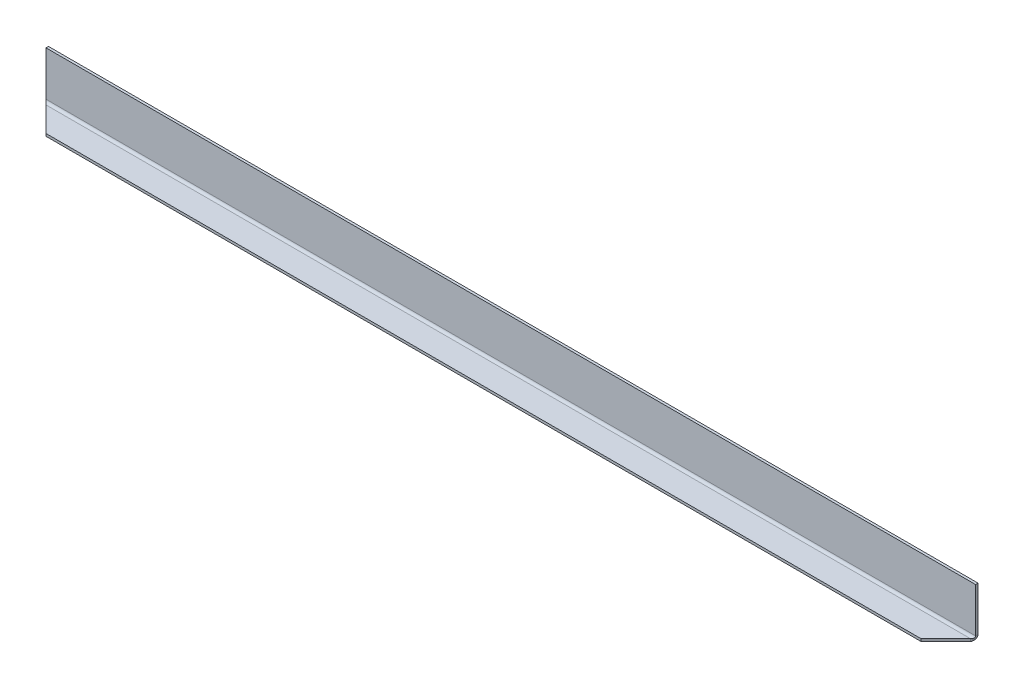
ISO-10303-21;
HEADER;
FILE_DESCRIPTION(('STEP AP214'),'2;1');
FILE_NAME('part.step','',(''),(''),'','','');
FILE_SCHEMA(('AUTOMOTIVE_DESIGN { 1 0 10303 214 1 1 1 1 }'));
ENDSEC;
DATA;
#1=APPLICATION_CONTEXT('core data for automotive mechanical design processes');
#2=APPLICATION_PROTOCOL_DEFINITION('international standard','automotive_design',2000,#1);
#3=PRODUCT_CONTEXT('',#1,'mechanical');
#4=PRODUCT('Part','Part','',(#3));
#5=PRODUCT_RELATED_PRODUCT_CATEGORY('part','',(#4));
#6=PRODUCT_DEFINITION_FORMATION('','',#4);
#7=PRODUCT_DEFINITION_CONTEXT('part definition',#1,'design');
#8=PRODUCT_DEFINITION('design','',#6,#7);
#9=PRODUCT_DEFINITION_SHAPE('','',#8);
#10=(LENGTH_UNIT() NAMED_UNIT(*) SI_UNIT(.MILLI.,.METRE.));
#11=(NAMED_UNIT(*) PLANE_ANGLE_UNIT() SI_UNIT($,.RADIAN.));
#12=(NAMED_UNIT(*) SI_UNIT($,.STERADIAN.) SOLID_ANGLE_UNIT());
#13=UNCERTAINTY_MEASURE_WITH_UNIT(LENGTH_MEASURE(1.E-05),#10,'distance_accuracy_value','');
#14=(GEOMETRIC_REPRESENTATION_CONTEXT(3) GLOBAL_UNCERTAINTY_ASSIGNED_CONTEXT((#13)) GLOBAL_UNIT_ASSIGNED_CONTEXT((#10,
#11,#12)) REPRESENTATION_CONTEXT('',''));
#15=CARTESIAN_POINT('',(0.,0.,0.));
#16=DIRECTION('',(0.,0.,1.));
#17=DIRECTION('',(1.,0.,0.));
#18=AXIS2_PLACEMENT_3D('',#15,#16,#17);
#19=CARTESIAN_POINT('',(637.101544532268,1.5875,0.));
#20=DIRECTION('',(0.,-1.,0.));
#21=DIRECTION('',(0.,0.,-1.));
#22=AXIS2_PLACEMENT_3D('',#19,#20,#21);
#23=PLANE('',#22);
#24=DIRECTION('',(-0.707106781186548,0.,-0.707106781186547));
#25=VECTOR('',#24,1.);
#26=CARTESIAN_POINT('',(318.550772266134,1.58749999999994,318.550772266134));
#27=LINE('',#26,#25);
#28=CARTESIAN_POINT('',(19.05,1.5875,19.05));
#29=VERTEX_POINT('',#28);
#30=CARTESIAN_POINT('',(3.17500000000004,1.5875,3.175));
#31=VERTEX_POINT('',#30);
#32=EDGE_CURVE('E176',#29,#31,#27,.T.);
#33=ORIENTED_EDGE('',*,*,#32,.F.);
#34=DIRECTION('',(-1.,0.,0.));
#35=VECTOR('',#34,1.);
#36=CARTESIAN_POINT('',(637.101544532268,1.5875,19.05));
#37=LINE('',#36,#35);
#38=CARTESIAN_POINT('',(581.025,1.58749999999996,19.05));
#39=VERTEX_POINT('',#38);
#40=EDGE_CURVE('E11',#39,#29,#37,.T.);
#41=ORIENTED_EDGE('',*,*,#40,.F.);
#42=DIRECTION('',(0.70710678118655,0.,-0.707106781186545));
#43=VECTOR('',#42,1.);
#44=CARTESIAN_POINT('',(618.588272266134,1.5875,-18.5132722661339));
#45=LINE('',#44,#43);
#46=CARTESIAN_POINT('',(596.9,1.5875,3.175));
#47=VERTEX_POINT('',#46);
#48=EDGE_CURVE('E200',#39,#47,#45,.T.);
#49=ORIENTED_EDGE('',*,*,#48,.T.);
#50=DIRECTION('',(-1.,0.,0.));
#51=VECTOR('',#50,1.);
#52=CARTESIAN_POINT('',(637.101544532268,1.5875,3.175));
#53=LINE('',#52,#51);
#54=EDGE_CURVE('E212',#47,#31,#53,.T.);
#55=ORIENTED_EDGE('',*,*,#54,.T.);
#56=EDGE_LOOP('',(#33,#41,#49,#55));
#57=FACE_BOUND('',#56,.T.);
#58=ADVANCED_FACE('F48',(#57),#23,.F.);
#59=CARTESIAN_POINT('',(637.101544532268,0.,19.05));
#60=DIRECTION('',(0.,0.,1.));
#61=DIRECTION('',(1.,0.,0.));
#62=AXIS2_PLACEMENT_3D('',#59,#60,#61);
#63=PLANE('',#62);
#64=ORIENTED_EDGE('',*,*,#40,.T.);
#65=DIRECTION('',(0.,-1.,0.));
#66=VECTOR('',#65,1.);
#67=CARTESIAN_POINT('',(19.05,0.,19.05));
#68=LINE('',#67,#66);
#69=CARTESIAN_POINT('',(19.05,0.,19.05));
#70=VERTEX_POINT('',#69);
#71=EDGE_CURVE('E172',#70,#29,#68,.F.);
#72=ORIENTED_EDGE('',*,*,#71,.F.);
#73=DIRECTION('',(-1.,0.,0.));
#74=VECTOR('',#73,1.);
#75=CARTESIAN_POINT('',(637.101544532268,0.,19.05));
#76=LINE('',#75,#74);
#77=CARTESIAN_POINT('',(581.025,0.,19.05));
#78=VERTEX_POINT('',#77);
#79=EDGE_CURVE('E56',#78,#70,#76,.T.);
#80=ORIENTED_EDGE('',*,*,#79,.F.);
#81=DIRECTION('',(0.,1.,0.));
#82=VECTOR('',#81,1.);
#83=CARTESIAN_POINT('',(581.025,1.58749999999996,19.05));
#84=LINE('',#83,#82);
#85=EDGE_CURVE('E170',#39,#78,#84,.F.);
#86=ORIENTED_EDGE('',*,*,#85,.F.);
#87=EDGE_LOOP('',(#64,#72,#80,#86));
#88=FACE_BOUND('',#87,.T.);
#89=ADVANCED_FACE('F169',(#88),#63,.T.);
#90=CARTESIAN_POINT('',(637.101544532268,0.,0.));
#91=DIRECTION('',(0.,-1.,0.));
#92=DIRECTION('',(0.,0.,-1.));
#93=AXIS2_PLACEMENT_3D('',#90,#91,#92);
#94=PLANE('',#93);
#95=ORIENTED_EDGE('',*,*,#79,.T.);
#96=DIRECTION('',(-0.707106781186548,0.,-0.707106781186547));
#97=VECTOR('',#96,1.);
#98=CARTESIAN_POINT('',(318.550772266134,0.,318.550772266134));
#99=LINE('',#98,#97);
#100=CARTESIAN_POINT('',(3.17500000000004,0.,3.175));
#101=VERTEX_POINT('',#100);
#102=EDGE_CURVE('E126',#70,#101,#99,.T.);
#103=ORIENTED_EDGE('',*,*,#102,.T.);
#104=DIRECTION('',(-1.,0.,0.));
#105=VECTOR('',#104,1.);
#106=CARTESIAN_POINT('',(637.101544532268,0.,3.175));
#107=LINE('',#106,#105);
#108=CARTESIAN_POINT('',(596.9,0.,3.175));
#109=VERTEX_POINT('',#108);
#110=EDGE_CURVE('E148',#109,#101,#107,.T.);
#111=ORIENTED_EDGE('',*,*,#110,.F.);
#112=DIRECTION('',(0.70710678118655,0.,-0.707106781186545));
#113=VECTOR('',#112,1.);
#114=CARTESIAN_POINT('',(618.588272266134,0.,-18.5132722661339));
#115=LINE('',#114,#113);
#116=EDGE_CURVE('E165',#78,#109,#115,.T.);
#117=ORIENTED_EDGE('',*,*,#116,.F.);
#118=EDGE_LOOP('',(#95,#103,#111,#117));
#119=FACE_BOUND('',#118,.T.);
#120=ADVANCED_FACE('F163',(#119),#94,.T.);
#121=CARTESIAN_POINT('',(637.101544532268,3.175,3.175));
#122=DIRECTION('',(-1.,0.,0.));
#123=DIRECTION('',(0.,0.,1.));
#124=AXIS2_PLACEMENT_3D('',#121,#122,#123);
#125=CYLINDRICAL_SURFACE('',#124,3.175);
#126=ORIENTED_EDGE('',*,*,#110,.T.);
#127=CARTESIAN_POINT('',(3.17500000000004,3.175,3.175));
#128=DIRECTION('',(-0.894427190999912,0.,0.447213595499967));
#129=DIRECTION('',(-0.447213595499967,0.,-0.894427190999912));
#130=AXIS2_PLACEMENT_3D('',#127,#128,#129);
#131=ELLIPSE('',#130,3.54975791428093,3.175);
#132=CARTESIAN_POINT('',(1.58750000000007,3.175,0.));
#133=VERTEX_POINT('',#132);
#134=EDGE_CURVE('E230',#101,#133,#131,.F.);
#135=ORIENTED_EDGE('',*,*,#134,.T.);
#136=DIRECTION('',(-1.,0.,0.));
#137=VECTOR('',#136,1.);
#138=CARTESIAN_POINT('',(637.101544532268,3.175,0.));
#139=LINE('',#138,#137);
#140=CARTESIAN_POINT('',(598.4875,3.175,0.));
#141=VERTEX_POINT('',#140);
#142=EDGE_CURVE('E136',#141,#133,#139,.T.);
#143=ORIENTED_EDGE('',*,*,#142,.F.);
#144=CARTESIAN_POINT('',(596.9,3.175,3.175));
#145=DIRECTION('',(-0.89442719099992,0.,-0.44721359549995));
#146=DIRECTION('',(-0.44721359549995,0.,0.89442719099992));
#147=AXIS2_PLACEMENT_3D('',#144,#145,#146);
#148=ELLIPSE('',#147,3.5497579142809,3.175);
#149=EDGE_CURVE('E186',#109,#141,#148,.F.);
#150=ORIENTED_EDGE('',*,*,#149,.F.);
#151=EDGE_LOOP('',(#126,#135,#143,#150));
#152=FACE_BOUND('',#151,.T.);
#153=ADVANCED_FACE('F247',(#152),#125,.T.);
#154=CARTESIAN_POINT('',(637.101544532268,0.,0.));
#155=DIRECTION('',(0.,0.,-1.));
#156=DIRECTION('',(-1.,0.,0.));
#157=AXIS2_PLACEMENT_3D('',#154,#155,#156);
#158=PLANE('',#157);
#159=ORIENTED_EDGE('',*,*,#142,.T.);
#160=DIRECTION('',(0.,1.,0.));
#161=VECTOR('',#160,1.);
#162=CARTESIAN_POINT('',(1.58750000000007,0.,0.));
#163=LINE('',#162,#161);
#164=CARTESIAN_POINT('',(1.58749999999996,31.75,0.));
#165=VERTEX_POINT('',#164);
#166=EDGE_CURVE('E117',#133,#165,#163,.T.);
#167=ORIENTED_EDGE('',*,*,#166,.T.);
#168=DIRECTION('',(-1.,0.,0.));
#169=VECTOR('',#168,1.);
#170=CARTESIAN_POINT('',(637.101544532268,31.75,0.));
#171=LINE('',#170,#169);
#172=CARTESIAN_POINT('',(598.4875,31.75,0.));
#173=VERTEX_POINT('',#172);
#174=EDGE_CURVE('E134',#173,#165,#171,.T.);
#175=ORIENTED_EDGE('',*,*,#174,.F.);
#176=DIRECTION('',(0.,1.,0.));
#177=VECTOR('',#176,1.);
#178=CARTESIAN_POINT('',(598.4875,0.,0.));
#179=LINE('',#178,#177);
#180=EDGE_CURVE('E192',#141,#173,#179,.T.);
#181=ORIENTED_EDGE('',*,*,#180,.F.);
#182=EDGE_LOOP('',(#159,#167,#175,#181));
#183=FACE_BOUND('',#182,.T.);
#184=ADVANCED_FACE('F132',(#183),#158,.T.);
#185=CARTESIAN_POINT('',(637.101544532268,31.75,1.5875));
#186=DIRECTION('',(0.,1.,0.));
#187=DIRECTION('',(0.,0.,1.));
#188=AXIS2_PLACEMENT_3D('',#185,#186,#187);
#189=PLANE('',#188);
#190=ORIENTED_EDGE('',*,*,#174,.T.);
#191=DIRECTION('',(0.,0.,1.));
#192=VECTOR('',#191,1.);
#193=CARTESIAN_POINT('',(1.58749999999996,31.75,1.5875));
#194=LINE('',#193,#192);
#195=CARTESIAN_POINT('',(1.58749999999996,31.75,1.5875));
#196=VERTEX_POINT('',#195);
#197=EDGE_CURVE('E113',#196,#165,#194,.F.);
#198=ORIENTED_EDGE('',*,*,#197,.F.);
#199=DIRECTION('',(-1.,0.,0.));
#200=VECTOR('',#199,1.);
#201=CARTESIAN_POINT('',(637.101544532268,31.75,1.5875));
#202=LINE('',#201,#200);
#203=CARTESIAN_POINT('',(598.4875,31.75,1.5875));
#204=VERTEX_POINT('',#203);
#205=EDGE_CURVE('E143',#204,#196,#202,.T.);
#206=ORIENTED_EDGE('',*,*,#205,.F.);
#207=DIRECTION('',(0.,0.,1.));
#208=VECTOR('',#207,1.);
#209=CARTESIAN_POINT('',(598.4875,31.75,1.5875));
#210=LINE('',#209,#208);
#211=EDGE_CURVE('E141',#204,#173,#210,.F.);
#212=ORIENTED_EDGE('',*,*,#211,.T.);
#213=EDGE_LOOP('',(#190,#198,#206,#212));
#214=FACE_BOUND('',#213,.T.);
#215=ADVANCED_FACE('F140',(#214),#189,.T.);
#216=CARTESIAN_POINT('',(637.101544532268,0.,1.5875));
#217=DIRECTION('',(0.,0.,-1.));
#218=DIRECTION('',(-1.,0.,0.));
#219=AXIS2_PLACEMENT_3D('',#216,#217,#218);
#220=PLANE('',#219);
#221=DIRECTION('',(0.,1.,0.));
#222=VECTOR('',#221,1.);
#223=CARTESIAN_POINT('',(1.58749999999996,0.,1.5875));
#224=LINE('',#223,#222);
#225=CARTESIAN_POINT('',(1.58750000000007,3.175,1.5875));
#226=VERTEX_POINT('',#225);
#227=EDGE_CURVE('E120',#226,#196,#224,.T.);
#228=ORIENTED_EDGE('',*,*,#227,.F.);
#229=DIRECTION('',(-1.,0.,0.));
#230=VECTOR('',#229,1.);
#231=CARTESIAN_POINT('',(637.101544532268,3.175,1.5875));
#232=LINE('',#231,#230);
#233=CARTESIAN_POINT('',(598.4875,3.175,1.5875));
#234=VERTEX_POINT('',#233);
#235=EDGE_CURVE('E150',#234,#226,#232,.T.);
#236=ORIENTED_EDGE('',*,*,#235,.F.);
#237=DIRECTION('',(0.,1.,0.));
#238=VECTOR('',#237,1.);
#239=CARTESIAN_POINT('',(598.4875,0.,1.5875));
#240=LINE('',#239,#238);
#241=EDGE_CURVE('E71',#234,#204,#240,.T.);
#242=ORIENTED_EDGE('',*,*,#241,.T.);
#243=ORIENTED_EDGE('',*,*,#205,.T.);
#244=EDGE_LOOP('',(#228,#236,#242,#243));
#245=FACE_BOUND('',#244,.T.);
#246=ADVANCED_FACE('F228',(#245),#220,.F.);
#247=CARTESIAN_POINT('',(637.101544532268,3.175,3.175));
#248=DIRECTION('',(-1.,0.,0.));
#249=DIRECTION('',(0.,0.,1.));
#250=AXIS2_PLACEMENT_3D('',#247,#248,#249);
#251=CYLINDRICAL_SURFACE('',#250,1.5875);
#252=CARTESIAN_POINT('',(3.17500000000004,3.175,3.175));
#253=DIRECTION('',(-0.707106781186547,0.,0.707106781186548));
#254=DIRECTION('',(-0.707106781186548,0.,-0.707106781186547));
#255=AXIS2_PLACEMENT_3D('',#252,#253,#254);
#256=ELLIPSE('',#255,2.24506403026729,1.5875);
#257=EDGE_CURVE('E225',#31,#226,#256,.F.);
#258=ORIENTED_EDGE('',*,*,#257,.F.);
#259=ORIENTED_EDGE('',*,*,#54,.F.);
#260=CARTESIAN_POINT('',(596.9,3.175,3.175));
#261=DIRECTION('',(-0.707106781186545,0.,-0.70710678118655));
#262=DIRECTION('',(-0.70710678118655,0.,0.707106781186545));
#263=AXIS2_PLACEMENT_3D('',#260,#261,#262);
#264=ELLIPSE('',#263,2.2450640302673,1.5875);
#265=EDGE_CURVE('E181',#47,#234,#264,.F.);
#266=ORIENTED_EDGE('',*,*,#265,.T.);
#267=ORIENTED_EDGE('',*,*,#235,.T.);
#268=EDGE_LOOP('',(#258,#259,#266,#267));
#269=FACE_BOUND('',#268,.T.);
#270=ADVANCED_FACE('F223',(#269),#251,.F.);
#271=CARTESIAN_POINT('',(618.588272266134,1.5875,-18.5132722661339));
#272=DIRECTION('',(-0.707106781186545,0.,-0.70710678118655));
#273=DIRECTION('',(0.70710678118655,0.,-0.707106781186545));
#274=AXIS2_PLACEMENT_3D('',#271,#272,#273);
#275=PLANE('',#274);
#276=DIRECTION('',(0.,1.,0.));
#277=VECTOR('',#276,1.);
#278=CARTESIAN_POINT('',(596.9,1.5875,3.175));
#279=LINE('',#278,#277);
#280=EDGE_CURVE('E208',#47,#109,#279,.F.);
#281=ORIENTED_EDGE('',*,*,#280,.F.);
#282=ORIENTED_EDGE('',*,*,#48,.F.);
#283=ORIENTED_EDGE('',*,*,#85,.T.);
#284=ORIENTED_EDGE('',*,*,#116,.T.);
#285=EDGE_LOOP('',(#281,#282,#283,#284));
#286=FACE_BOUND('',#285,.T.);
#287=ADVANCED_FACE('F253',(#286),#275,.F.);
#288=CARTESIAN_POINT('',(598.4875,0.,1.5875));
#289=DIRECTION('',(-1.,0.,0.));
#290=DIRECTION('',(0.,1.,0.));
#291=AXIS2_PLACEMENT_3D('',#288,#289,#290);
#292=PLANE('',#291);
#293=ORIENTED_EDGE('',*,*,#211,.F.);
#294=ORIENTED_EDGE('',*,*,#241,.F.);
#295=DIRECTION('',(0.,0.,1.));
#296=VECTOR('',#295,1.);
#297=CARTESIAN_POINT('',(598.4875,3.175,1.5875));
#298=LINE('',#297,#296);
#299=EDGE_CURVE('E195',#234,#141,#298,.F.);
#300=ORIENTED_EDGE('',*,*,#299,.T.);
#301=ORIENTED_EDGE('',*,*,#180,.T.);
#302=EDGE_LOOP('',(#293,#294,#300,#301));
#303=FACE_BOUND('',#302,.T.);
#304=ADVANCED_FACE('F251',(#303),#292,.F.);
#305=CARTESIAN_POINT('',(595.3125,3.175,6.35));
#306=CARTESIAN_POINT('',(595.3125,3.175,5.82083333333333));
#307=CARTESIAN_POINT('',(595.3125,3.175,5.29166666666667));
#308=CARTESIAN_POINT('',(595.3125,3.175,4.7625));
#309=CARTESIAN_POINT('',(595.3125,-3.175,6.35));
#310=CARTESIAN_POINT('',(595.3125,-2.11666666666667,5.82083333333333));
#311=CARTESIAN_POINT('',(595.3125,-1.05833333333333,5.29166666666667));
#312=CARTESIAN_POINT('',(595.3125,0.,4.7625));
#313=CARTESIAN_POINT('',(598.4875,-3.175,0.));
#314=CARTESIAN_POINT('',(598.4875,-2.11666666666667,0.529166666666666));
#315=CARTESIAN_POINT('',(598.4875,-1.05833333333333,1.05833333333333));
#316=CARTESIAN_POINT('',(598.4875,0.,1.5875));
#317=CARTESIAN_POINT('',(598.4875,3.175,0.));
#318=CARTESIAN_POINT('',(598.4875,3.175,0.529166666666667));
#319=CARTESIAN_POINT('',(598.4875,3.175,1.05833333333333));
#320=CARTESIAN_POINT('',(598.4875,3.175,1.5875));
#321=CARTESIAN_POINT('',(598.4875,9.525,0.));
#322=CARTESIAN_POINT('',(598.4875,8.46666666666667,0.529166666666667));
#323=CARTESIAN_POINT('',(598.4875,7.40833333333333,1.05833333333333));
#324=CARTESIAN_POINT('',(598.4875,6.35,1.5875));
#325=CARTESIAN_POINT('',(595.3125,9.525,6.35));
#326=CARTESIAN_POINT('',(595.3125,8.46666666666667,5.82083333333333));
#327=CARTESIAN_POINT('',(595.3125,7.40833333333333,5.29166666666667));
#328=CARTESIAN_POINT('',(595.3125,6.35,4.7625));
#329=CARTESIAN_POINT('',(595.3125,3.175,6.35));
#330=CARTESIAN_POINT('',(595.3125,3.175,5.82083333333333));
#331=CARTESIAN_POINT('',(595.3125,3.175,5.29166666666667));
#332=CARTESIAN_POINT('',(595.3125,3.175,4.7625));
#333=(BOUNDED_SURFACE() B_SPLINE_SURFACE(3,3,((#305,#306,#307,#308),(#309,#310,#311,#312),(#313,
#314,#315,#316),(#317,#318,#319,#320),(#321,#322,#323,#324),(#325,#326,#327,#328),(#329,#330,
#331,#332)),.UNSPECIFIED.,.T.,.F.,.F.) B_SPLINE_SURFACE_WITH_KNOTS((4,3,4),(4,4),(0.,0.5,1.),
(0.,1.),.UNSPECIFIED.) GEOMETRIC_REPRESENTATION_ITEM() RATIONAL_B_SPLINE_SURFACE(((1.,1.,1.,1.),
(0.333333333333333,0.333333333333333,0.333333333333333,0.333333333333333),(0.333333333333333,
0.333333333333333,0.333333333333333,0.333333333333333),(1.,1.,1.,1.),(0.333333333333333,
0.333333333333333,0.333333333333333,0.333333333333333),(0.333333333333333,0.333333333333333,
0.333333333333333,0.333333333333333),(1.,1.,1.,1.))) REPRESENTATION_ITEM('') SURFACE());
#334=ORIENTED_EDGE('',*,*,#299,.F.);
#335=ORIENTED_EDGE('',*,*,#265,.F.);
#336=ORIENTED_EDGE('',*,*,#280,.T.);
#337=ORIENTED_EDGE('',*,*,#149,.T.);
#338=EDGE_LOOP('',(#334,#335,#336,#337));
#339=FACE_BOUND('',#338,.T.);
#340=ADVANCED_FACE('F250',(#339),#333,.T.);
#341=CARTESIAN_POINT('',(318.550772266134,0.,318.550772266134));
#342=DIRECTION('',(-0.707106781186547,0.,0.707106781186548));
#343=DIRECTION('',(-0.707106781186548,0.,-0.707106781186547));
#344=AXIS2_PLACEMENT_3D('',#341,#342,#343);
#345=PLANE('',#344);
#346=DIRECTION('',(0.,-1.,0.));
#347=VECTOR('',#346,1.);
#348=CARTESIAN_POINT('',(3.17500000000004,0.,3.175));
#349=LINE('',#348,#347);
#350=EDGE_CURVE('E63',#101,#31,#349,.F.);
#351=ORIENTED_EDGE('',*,*,#350,.F.);
#352=ORIENTED_EDGE('',*,*,#102,.F.);
#353=ORIENTED_EDGE('',*,*,#71,.T.);
#354=ORIENTED_EDGE('',*,*,#32,.T.);
#355=EDGE_LOOP('',(#351,#352,#353,#354));
#356=FACE_BOUND('',#355,.T.);
#357=ADVANCED_FACE('F259',(#356),#345,.T.);
#358=CARTESIAN_POINT('',(1.58749999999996,0.,1.5875));
#359=DIRECTION('',(-1.,0.,0.));
#360=DIRECTION('',(0.,1.,0.));
#361=AXIS2_PLACEMENT_3D('',#358,#359,#360);
#362=PLANE('',#361);
#363=ORIENTED_EDGE('',*,*,#227,.T.);
#364=ORIENTED_EDGE('',*,*,#197,.T.);
#365=ORIENTED_EDGE('',*,*,#166,.F.);
#366=DIRECTION('',(0.,0.,1.));
#367=VECTOR('',#366,1.);
#368=CARTESIAN_POINT('',(1.58750000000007,3.175,1.5875));
#369=LINE('',#368,#367);
#370=EDGE_CURVE('E127',#226,#133,#369,.F.);
#371=ORIENTED_EDGE('',*,*,#370,.F.);
#372=EDGE_LOOP('',(#363,#364,#365,#371));
#373=FACE_BOUND('',#372,.T.);
#374=ADVANCED_FACE('F115',(#373),#362,.T.);
#375=CARTESIAN_POINT('',(1.5875,3.175,0.));
#376=CARTESIAN_POINT('',(1.58750000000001,3.175,0.529166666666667));
#377=CARTESIAN_POINT('',(1.58750000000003,3.175,1.05833333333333));
#378=CARTESIAN_POINT('',(1.58750000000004,3.175,1.5875));
#379=CARTESIAN_POINT('',(1.5875,9.525,0.));
#380=CARTESIAN_POINT('',(1.58750000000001,8.46666666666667,0.529166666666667));
#381=CARTESIAN_POINT('',(1.58750000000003,7.40833333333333,1.05833333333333));
#382=CARTESIAN_POINT('',(1.58750000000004,6.35,1.5875));
#383=CARTESIAN_POINT('',(4.76250000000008,9.525,6.35));
#384=CARTESIAN_POINT('',(4.76250000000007,8.46666666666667,5.82083333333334));
#385=CARTESIAN_POINT('',(4.76250000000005,7.40833333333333,5.29166666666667));
#386=CARTESIAN_POINT('',(4.76250000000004,6.35,4.7625));
#387=CARTESIAN_POINT('',(4.76250000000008,3.175,6.35));
#388=CARTESIAN_POINT('',(4.76250000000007,3.175,5.82083333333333));
#389=CARTESIAN_POINT('',(4.76250000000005,3.175,5.29166666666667));
#390=CARTESIAN_POINT('',(4.76250000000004,3.175,4.7625));
#391=CARTESIAN_POINT('',(4.76250000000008,-3.175,6.35));
#392=CARTESIAN_POINT('',(4.76250000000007,-2.11666666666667,5.82083333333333));
#393=CARTESIAN_POINT('',(4.76250000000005,-1.05833333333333,5.29166666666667));
#394=CARTESIAN_POINT('',(4.76250000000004,0.,4.7625));
#395=CARTESIAN_POINT('',(1.5875,-3.175,0.));
#396=CARTESIAN_POINT('',(1.58750000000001,-2.11666666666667,0.529166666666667));
#397=CARTESIAN_POINT('',(1.58750000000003,-1.05833333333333,1.05833333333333));
#398=CARTESIAN_POINT('',(1.58750000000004,0.,1.5875));
#399=CARTESIAN_POINT('',(1.5875,3.175,0.));
#400=CARTESIAN_POINT('',(1.58750000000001,3.175,0.529166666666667));
#401=CARTESIAN_POINT('',(1.58750000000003,3.175,1.05833333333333));
#402=CARTESIAN_POINT('',(1.58750000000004,3.175,1.5875));
#403=(BOUNDED_SURFACE() B_SPLINE_SURFACE(3,3,((#375,#376,#377,#378),(#379,#380,#381,#382),(#383,
#384,#385,#386),(#387,#388,#389,#390),(#391,#392,#393,#394),(#395,#396,#397,#398),(#399,#400,
#401,#402)),.UNSPECIFIED.,.T.,.F.,.F.) B_SPLINE_SURFACE_WITH_KNOTS((4,3,4),(4,4),(0.,0.5,1.),
(0.,1.),.UNSPECIFIED.) GEOMETRIC_REPRESENTATION_ITEM() RATIONAL_B_SPLINE_SURFACE(((1.,1.,1.,1.),
(0.333333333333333,0.333333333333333,0.333333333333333,0.333333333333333),(0.333333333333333,
0.333333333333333,0.333333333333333,0.333333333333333),(1.,1.,1.,1.),(0.333333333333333,
0.333333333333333,0.333333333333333,0.333333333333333),(0.333333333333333,0.333333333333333,
0.333333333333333,0.333333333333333),(1.,1.,1.,1.))) REPRESENTATION_ITEM('') SURFACE());
#404=ORIENTED_EDGE('',*,*,#257,.T.);
#405=ORIENTED_EDGE('',*,*,#370,.T.);
#406=ORIENTED_EDGE('',*,*,#134,.F.);
#407=ORIENTED_EDGE('',*,*,#350,.T.);
#408=EDGE_LOOP('',(#404,#405,#406,#407));
#409=FACE_BOUND('',#408,.T.);
#410=ADVANCED_FACE('F245',(#409),#403,.F.);
#411=CLOSED_SHELL('',(#58,#89,#120,#153,#184,#215,#246,#270,#287,#304,#340,#357,#374,#410));
#412=MANIFOLD_SOLID_BREP('B2',#411);
#413=ADVANCED_BREP_SHAPE_REPRESENTATION('',(#18,#412),#14);
#414=SHAPE_DEFINITION_REPRESENTATION(#9,#413);
ENDSEC;
END-ISO-10303-21;
